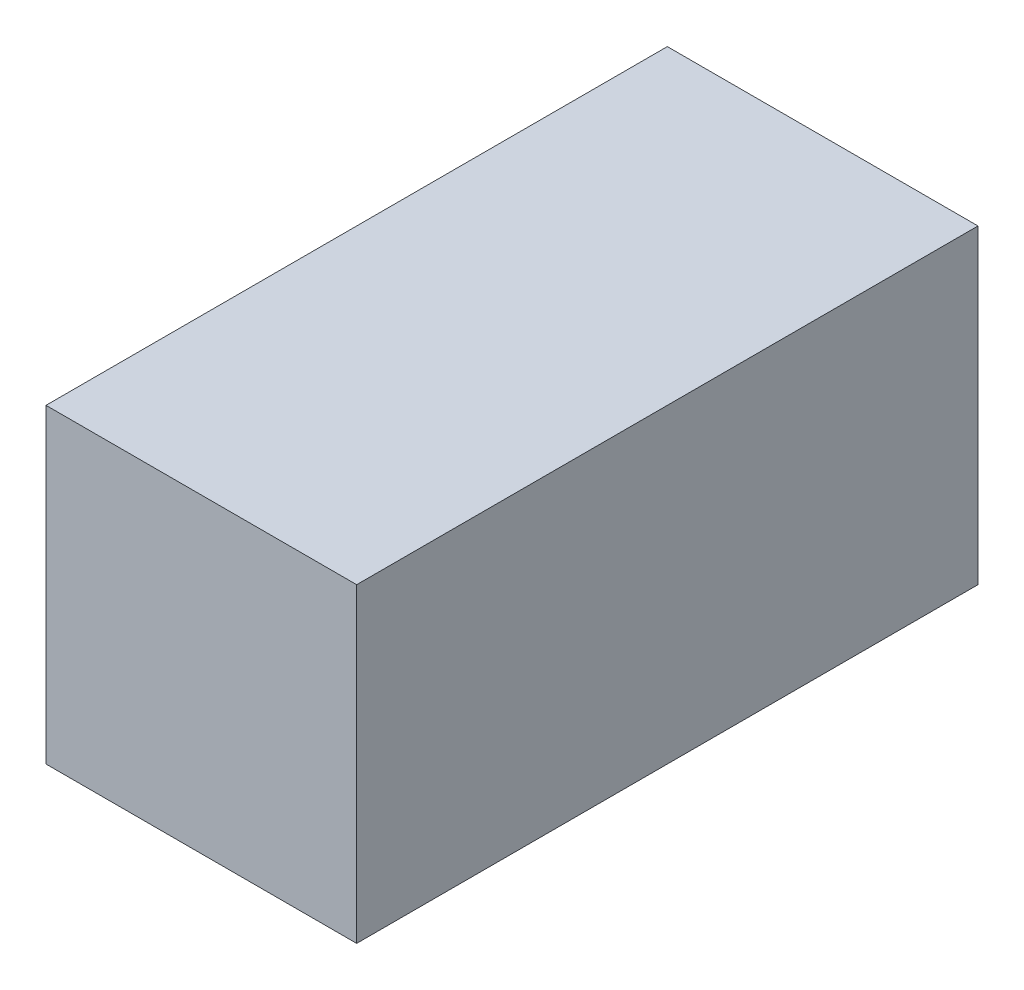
from build123d import *

# Parameters (mm, degrees)
ESQUISSE1_W          = 4
ESQUISSE1_H          = 4
BASE_EXTRUSION_DEPTH = 8


with BuildPart() as part:
    # Esquisse1 → Base-Extrusion (new body)
    with BuildSketch(Plane.XY):
        with Locations((2, 2)):
            Rectangle(ESQUISSE1_W, ESQUISSE1_H)
    extrude(amount=BASE_EXTRUSION_DEPTH)


solid = part.part
